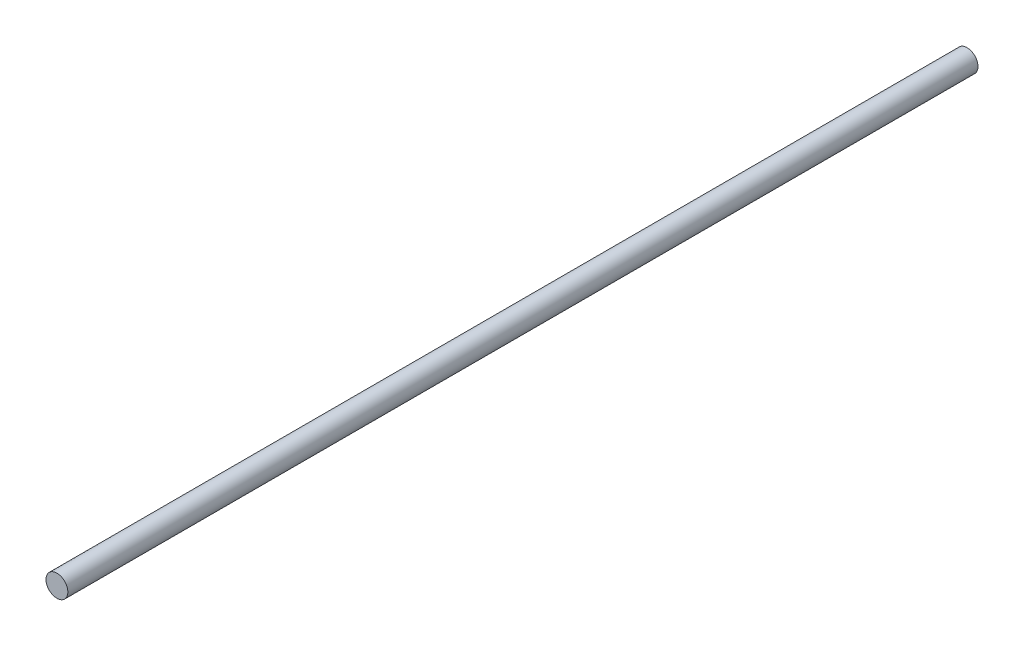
from build123d import *

# Parameters (mm, degrees)
SKETCH1_R           = 30
BOSS_EXTRUDE1_DEPTH = 2500


with BuildPart() as part:
    # Sketch1 → Boss-Extrude1 (new body)
    with BuildSketch(Plane.XY):
        Circle(SKETCH1_R)
    extrude(amount=-BOSS_EXTRUDE1_DEPTH)


solid = part.part
